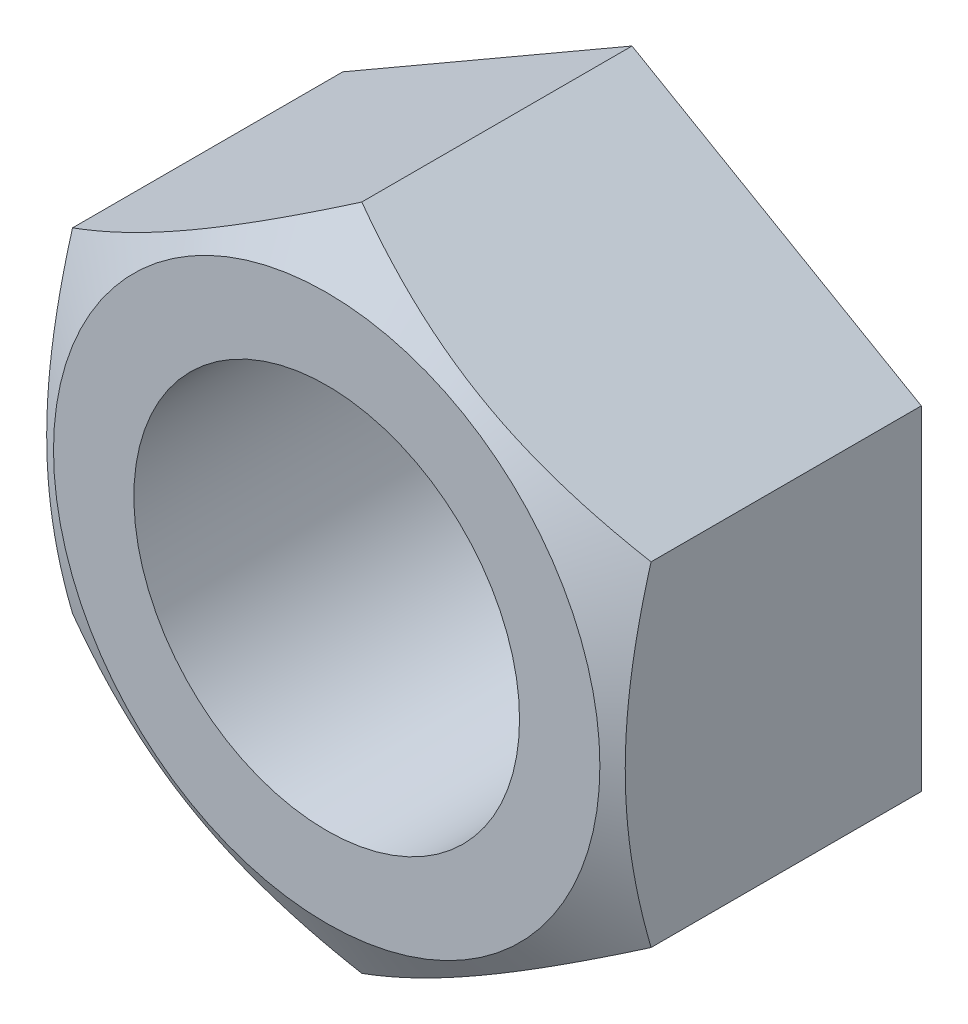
ISO-10303-21;
HEADER;
FILE_DESCRIPTION(('STEP AP214'),'2;1');
FILE_NAME('part.step','',(''),(''),'','','');
FILE_SCHEMA(('AUTOMOTIVE_DESIGN { 1 0 10303 214 1 1 1 1 }'));
ENDSEC;
DATA;
#1=APPLICATION_CONTEXT('core data for automotive mechanical design processes');
#2=APPLICATION_PROTOCOL_DEFINITION('international standard','automotive_design',2000,#1);
#3=PRODUCT_CONTEXT('',#1,'mechanical');
#4=PRODUCT('Part','Part','',(#3));
#5=PRODUCT_RELATED_PRODUCT_CATEGORY('part','',(#4));
#6=PRODUCT_DEFINITION_FORMATION('','',#4);
#7=PRODUCT_DEFINITION_CONTEXT('part definition',#1,'design');
#8=PRODUCT_DEFINITION('design','',#6,#7);
#9=PRODUCT_DEFINITION_SHAPE('','',#8);
#10=(LENGTH_UNIT() NAMED_UNIT(*) SI_UNIT(.MILLI.,.METRE.));
#11=(NAMED_UNIT(*) PLANE_ANGLE_UNIT() SI_UNIT($,.RADIAN.));
#12=(NAMED_UNIT(*) SI_UNIT($,.STERADIAN.) SOLID_ANGLE_UNIT());
#13=UNCERTAINTY_MEASURE_WITH_UNIT(LENGTH_MEASURE(1.E-05),#10,'distance_accuracy_value','');
#14=(GEOMETRIC_REPRESENTATION_CONTEXT(3) GLOBAL_UNCERTAINTY_ASSIGNED_CONTEXT((#13)) GLOBAL_UNIT_ASSIGNED_CONTEXT((#10,
#11,#12)) REPRESENTATION_CONTEXT('',''));
#15=CARTESIAN_POINT('',(0.,0.,0.));
#16=DIRECTION('',(0.,0.,1.));
#17=DIRECTION('',(1.,0.,0.));
#18=AXIS2_PLACEMENT_3D('',#15,#16,#17);
#19=CARTESIAN_POINT('',(-18.,-10.3923048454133,21.));
#20=DIRECTION('',(-1.,0.,0.));
#21=DIRECTION('',(0.,0.,1.));
#22=AXIS2_PLACEMENT_3D('',#19,#20,#21);
#23=PLANE('',#22);
#24=DIRECTION('',(0.,1.,0.));
#25=VECTOR('',#24,1.);
#26=CARTESIAN_POINT('',(-18.,-10.3923048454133,0.));
#27=LINE('',#26,#25);
#28=CARTESIAN_POINT('',(-18.,-10.3923048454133,0.));
#29=VERTEX_POINT('',#28);
#30=CARTESIAN_POINT('',(-18.,10.3923048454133,0.));
#31=VERTEX_POINT('',#30);
#32=EDGE_CURVE('E97',#29,#31,#27,.T.);
#33=ORIENTED_EDGE('',*,*,#32,.F.);
#34=DIRECTION('',(0.,0.,-1.));
#35=VECTOR('',#34,1.);
#36=CARTESIAN_POINT('',(-18.,-10.3923048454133,21.));
#37=LINE('',#36,#35);
#38=CARTESIAN_POINT('',(-18.,-10.3923048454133,16.8149545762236));
#39=VERTEX_POINT('',#38);
#40=EDGE_CURVE('E9',#39,#29,#37,.T.);
#41=ORIENTED_EDGE('',*,*,#40,.F.);
#42=CARTESIAN_POINT('',(-18.,-27.678158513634,9.75294647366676));
#43=CARTESIAN_POINT('',(-18.,-27.2860533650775,9.94272235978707));
#44=CARTESIAN_POINT('',(-18.,-26.8934816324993,10.1315337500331));
#45=CARTESIAN_POINT('',(-18.,-26.1073075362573,10.5070086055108));
#46=CARTESIAN_POINT('',(-18.,-25.7137051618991,10.693672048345));
#47=CARTESIAN_POINT('',(-18.,-24.5310977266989,11.2501628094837));
#48=CARTESIAN_POINT('',(-18.,-23.7404120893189,11.6164324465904));
#49=CARTESIAN_POINT('',(-18.,-22.1492517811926,12.3392469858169));
#50=CARTESIAN_POINT('',(-18.,-21.3487470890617,12.6957259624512));
#51=CARTESIAN_POINT('',(-18.,-19.7412878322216,13.3937806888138));
#52=CARTESIAN_POINT('',(-18.,-18.9343335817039,13.7353571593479));
#53=CARTESIAN_POINT('',(-18.,-17.2876078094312,14.4099305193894));
#54=CARTESIAN_POINT('',(-18.,-16.4475927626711,14.7423360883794));
#55=CARTESIAN_POINT('',(-18.,-14.7576419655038,15.3814120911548));
#56=CARTESIAN_POINT('',(-18.,-13.9077051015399,15.6880796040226));
#57=CARTESIAN_POINT('',(-18.,-12.1982556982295,16.2674507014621));
#58=CARTESIAN_POINT('',(-18.,-11.3387673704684,16.5402251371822));
#59=CARTESIAN_POINT('',(-18.,-9.60738310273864,17.042915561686));
#60=CARTESIAN_POINT('',(-18.,-8.73549124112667,17.2728453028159));
#61=CARTESIAN_POINT('',(-18.,-7.42060770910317,17.5765484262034));
#62=CARTESIAN_POINT('',(-18.,-6.98229810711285,17.6707239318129));
#63=CARTESIAN_POINT('',(-18.,-6.10272947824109,17.8441982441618));
#64=CARTESIAN_POINT('',(-18.,-5.66147051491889,17.9234973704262));
#65=CARTESIAN_POINT('',(-18.,-4.77633197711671,18.0658039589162));
#66=CARTESIAN_POINT('',(-18.,-4.33245247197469,18.1288118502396));
#67=CARTESIAN_POINT('',(-18.,-3.44253895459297,18.2372744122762));
#68=CARTESIAN_POINT('',(-18.,-2.99650494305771,18.2827290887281));
#69=CARTESIAN_POINT('',(-18.,-2.10864948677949,18.3546213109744));
#70=CARTESIAN_POINT('',(-18.,-1.66684728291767,18.3812950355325));
#71=CARTESIAN_POINT('',(-18.,-0.78251257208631,18.4159525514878));
#72=CARTESIAN_POINT('',(-18.,-0.339980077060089,18.4239366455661));
#73=CARTESIAN_POINT('',(-18.,0.545029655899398,18.4210256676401));
#74=CARTESIAN_POINT('',(-18.,0.987506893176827,18.4101303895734));
#75=CARTESIAN_POINT('',(-18.,1.8716145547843,18.3697222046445));
#76=CARTESIAN_POINT('',(-18.,2.31324493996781,18.3402084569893));
#77=CARTESIAN_POINT('',(-18.,3.38188442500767,18.2468825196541));
#78=CARTESIAN_POINT('',(-18.,4.0081005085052,18.1738337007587));
#79=CARTESIAN_POINT('',(-18.,5.2557313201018,17.9943375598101));
#80=CARTESIAN_POINT('',(-18.,5.87714535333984,17.8878854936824));
#81=CARTESIAN_POINT('',(-18.,7.11463218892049,17.6453701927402));
#82=CARTESIAN_POINT('',(-18.,7.73070028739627,17.509283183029));
#83=CARTESIAN_POINT('',(-18.,8.95658242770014,17.2116364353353));
#84=CARTESIAN_POINT('',(-18.,9.56639657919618,17.0500771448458));
#85=CARTESIAN_POINT('',(-18.,10.7930692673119,16.7016152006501));
#86=CARTESIAN_POINT('',(-18.,11.4097918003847,16.5142370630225));
#87=CARTESIAN_POINT('',(-18.,12.6371592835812,16.1206335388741));
#88=CARTESIAN_POINT('',(-18.,13.247804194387,15.9144080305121));
#89=CARTESIAN_POINT('',(-18.,14.4633274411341,15.4863391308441));
#90=CARTESIAN_POINT('',(-18.,15.068207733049,15.2645012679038));
#91=CARTESIAN_POINT('',(-18.,16.272990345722,14.8077670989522));
#92=CARTESIAN_POINT('',(-18.,16.8728927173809,14.5728709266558));
#93=CARTESIAN_POINT('',(-18.,18.2575646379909,14.0160878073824));
#94=CARTESIAN_POINT('',(-18.,19.0407253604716,13.6902065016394));
#95=CARTESIAN_POINT('',(-18.,20.6006658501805,13.0234723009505));
#96=CARTESIAN_POINT('',(-18.,21.3774452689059,12.6826185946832));
#97=CARTESIAN_POINT('',(-18.,22.9257732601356,11.988856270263));
#98=CARTESIAN_POINT('',(-18.,23.6973207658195,11.6359452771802));
#99=CARTESIAN_POINT('',(-18.,25.2358803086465,10.9204307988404));
#100=CARTESIAN_POINT('',(-18.,26.0028924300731,10.557827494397));
#101=CARTESIAN_POINT('',(-18.,27.5338791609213,9.82432596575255));
#102=CARTESIAN_POINT('',(-18.,28.2978499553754,9.4534197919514));
#103=CARTESIAN_POINT('',(-18.,29.8225723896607,8.70505034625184));
#104=CARTESIAN_POINT('',(-18.,30.58332401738,8.32758704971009));
#105=CARTESIAN_POINT('',(-18.,32.1020057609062,7.56724265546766));
#106=CARTESIAN_POINT('',(-18.,32.8599361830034,7.18436216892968));
#107=CARTESIAN_POINT('',(-18.,34.3734558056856,6.41400905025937));
#108=CARTESIAN_POINT('',(-18.,35.12904501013,6.02653642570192));
#109=CARTESIAN_POINT('',(-18.,37.2715446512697,4.92088640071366));
#110=CARTESIAN_POINT('',(-18.,38.6560721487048,4.1980913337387));
#111=CARTESIAN_POINT('',(-18.,41.4199837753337,2.74265154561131));
#112=CARTESIAN_POINT('',(-18.,42.7993677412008,2.01000651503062));
#113=CARTESIAN_POINT('',(-18.,45.5509144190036,0.538834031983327));
#114=CARTESIAN_POINT('',(-18.,46.9230864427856,-0.199676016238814));
#115=CARTESIAN_POINT('',(-18.,48.9789029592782,-1.31186595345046));
#116=CARTESIAN_POINT('',(-18.,49.6637511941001,-1.68332410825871));
#117=CARTESIAN_POINT('',(-18.,51.0327239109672,-2.42756928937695));
#118=CARTESIAN_POINT('',(-18.,51.7168483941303,-2.80035631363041));
#119=CARTESIAN_POINT('',(-18.,52.4006513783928,-3.17373230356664));
#120=B_SPLINE_CURVE_WITH_KNOTS('',3,(#42,#43,#44,#45,#46,#47,#48,#49,#50,#51,#52,#53,#54,#55,
#56,#57,#58,#59,#60,#61,#62,#63,#64,#65,#66,#67,#68,#69,#70,#71,#72,#73,#74,#75,#76,#77,#78,#79,
#80,#81,#82,#83,#84,#85,#86,#87,#88,#89,#90,#91,#92,#93,#94,#95,#96,#97,#98,#99,#100,#101,#102,
#103,#104,#105,#106,#107,#108,#109,#110,#111,#112,#113,#114,#115,#116,#117,#118,#119),
.UNSPECIFIED.,.F.,.F.,(4,2,2,2,2,2,2,2,2,2,2,2,2,2,2,2,2,2,2,2,2,2,2,2,2,2,2,2,2,2,2,2,2,2,2,2,
2,2,4),(0.,1.30684567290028,2.61370496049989,5.22782279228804,7.85657604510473,10.4852020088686,
13.1950587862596,15.9052226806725,18.6096222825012,21.3131523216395,22.657878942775,
24.0025766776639,25.347238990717,26.69190086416,28.0193354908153,29.3467486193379,
30.6741762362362,32.0016638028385,33.8919994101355,35.7826036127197,37.6747301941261,
39.5668235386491,41.5001415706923,43.4334721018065,45.3661214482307,47.2987510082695,
49.8433127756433,52.3880125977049,54.933216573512,57.4783731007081,60.0260805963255,
62.5737976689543,65.1212295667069,67.6686572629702,72.3541222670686,77.0397348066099,
81.7145709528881,84.0518726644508,86.3891707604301),.UNSPECIFIED.);
#121=CARTESIAN_POINT('',(-18.,10.3923048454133,16.8149545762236));
#122=VERTEX_POINT('',#121);
#123=EDGE_CURVE('E36',#39,#122,#120,.T.);
#124=ORIENTED_EDGE('',*,*,#123,.T.);
#125=DIRECTION('',(0.,0.,-1.));
#126=VECTOR('',#125,1.);
#127=CARTESIAN_POINT('',(-18.,10.3923048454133,21.));
#128=LINE('',#127,#126);
#129=EDGE_CURVE('E177',#122,#31,#128,.T.);
#130=ORIENTED_EDGE('',*,*,#129,.T.);
#131=EDGE_LOOP('',(#33,#41,#124,#130));
#132=FACE_BOUND('',#131,.T.);
#133=ADVANCED_FACE('F14',(#132),#23,.T.);
#134=CARTESIAN_POINT('',(-18.,-10.3923048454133,21.));
#135=DIRECTION('',(0.5,0.86602540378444,0.));
#136=DIRECTION('',(-0.86602540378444,0.5,0.));
#137=AXIS2_PLACEMENT_3D('',#134,#135,#136);
#138=PLANE('',#137);
#139=DIRECTION('',(-0.866025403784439,0.5,0.));
#140=VECTOR('',#139,1.);
#141=CARTESIAN_POINT('',(0.,-20.7846096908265,0.));
#142=LINE('',#141,#140);
#143=CARTESIAN_POINT('',(0.,-20.7846096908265,0.));
#144=VERTEX_POINT('',#143);
#145=EDGE_CURVE('E94',#144,#29,#142,.T.);
#146=ORIENTED_EDGE('',*,*,#145,.F.);
#147=DIRECTION('',(0.,0.,-1.));
#148=VECTOR('',#147,1.);
#149=CARTESIAN_POINT('',(0.,-20.7846096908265,21.));
#150=LINE('',#149,#148);
#151=CARTESIAN_POINT('',(0.,-20.7846096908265,16.8149545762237));
#152=VERTEX_POINT('',#151);
#153=EDGE_CURVE('E23',#152,#144,#150,.T.);
#154=ORIENTED_EDGE('',*,*,#153,.F.);
#155=CARTESIAN_POINT('',(-18.0002,-10.3921893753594,16.8148879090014));
#156=CARTESIAN_POINT('',(-17.6045674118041,-10.6206079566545,16.9467563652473));
#157=CARTESIAN_POINT('',(-17.2073916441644,-10.8499174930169,17.0726408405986));
#158=CARTESIAN_POINT('',(-16.4098552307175,-11.310375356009,17.3107784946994));
#159=CARTESIAN_POINT('',(-16.0094935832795,-11.5415242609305,17.423027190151));
#160=CARTESIAN_POINT('',(-15.2048116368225,-12.0061075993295,17.6323844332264));
#161=CARTESIAN_POINT('',(-14.8004842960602,-12.2395460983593,17.7294571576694));
#162=CARTESIAN_POINT('',(-13.9890201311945,-12.7080451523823,17.9063779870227));
#163=CARTESIAN_POINT('',(-13.5818834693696,-12.9431056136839,17.9862270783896));
#164=CARTESIAN_POINT('',(-12.7752328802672,-13.4088255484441,18.1253044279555));
#165=CARTESIAN_POINT('',(-12.3757788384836,-13.6394504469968,18.1849930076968));
#166=CARTESIAN_POINT('',(-11.5750403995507,-14.1017570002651,18.2850773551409));
#167=CARTESIAN_POINT('',(-11.1737559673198,-14.3334386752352,18.3254727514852));
#168=CARTESIAN_POINT('',(-10.370513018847,-14.7971912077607,18.3859507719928));
#169=CARTESIAN_POINT('',(-9.96855587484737,-15.0292612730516,18.4060575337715));
#170=CARTESIAN_POINT('',(-9.16427056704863,-15.4936156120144,18.425525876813));
#171=CARTESIAN_POINT('',(-8.76194241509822,-15.7258998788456,18.4248880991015));
#172=CARTESIAN_POINT('',(-8.0097806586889,-16.1601606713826,18.404316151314));
#173=CARTESIAN_POINT('',(-7.65989346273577,-16.3621681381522,18.3868905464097));
#174=CARTESIAN_POINT('',(-6.96095368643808,-16.765701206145,18.3366806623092));
#175=CARTESIAN_POINT('',(-6.61190109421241,-16.9672268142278,18.3038966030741));
#176=CARTESIAN_POINT('',(-5.91476277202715,-17.3697198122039,18.2235386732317));
#177=CARTESIAN_POINT('',(-5.56667820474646,-17.5706865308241,18.1759514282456));
#178=CARTESIAN_POINT('',(-4.87216610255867,-17.9716632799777,18.0668268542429));
#179=CARTESIAN_POINT('',(-4.5257385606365,-18.1716733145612,18.0052895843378));
#180=CARTESIAN_POINT('',(-3.47411308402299,-18.7788295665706,17.7981876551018));
#181=CARTESIAN_POINT('',(-2.77196054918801,-19.1842175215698,17.6319722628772));
#182=CARTESIAN_POINT('',(-1.37812528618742,-19.9889486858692,17.2547315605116));
#183=CARTESIAN_POINT('',(-0.686424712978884,-20.3883021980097,17.0437948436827));
#184=CARTESIAN_POINT('',(0.00019999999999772,-20.7847251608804,16.8148879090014));
#185=B_SPLINE_CURVE_WITH_KNOTS('',3,(#155,#156,#157,#158,#159,#160,#161,#162,#163,#164,#165,
#166,#167,#168,#169,#170,#171,#172,#173,#174,#175,#176,#177,#178,#179,#180,#181,#182,#183,#184),
.UNSPECIFIED.,.F.,.F.,(4,2,2,2,2,2,2,2,2,2,2,2,2,2,4),(0.,1.42650335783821,2.85347447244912,
4.28376471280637,5.71397301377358,7.10888071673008,8.5038152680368,9.8970882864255,
11.2903182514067,12.5031974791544,13.7160593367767,14.9300201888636,16.1439758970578,
18.6253607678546,21.1018751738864),.UNSPECIFIED.);
#186=EDGE_CURVE('E146',#39,#152,#185,.T.);
#187=ORIENTED_EDGE('',*,*,#186,.F.);
#188=ORIENTED_EDGE('',*,*,#40,.T.);
#189=EDGE_LOOP('',(#146,#154,#187,#188));
#190=FACE_BOUND('',#189,.T.);
#191=ADVANCED_FACE('F16',(#190),#138,.F.);
#192=CARTESIAN_POINT('',(18.,-10.3923048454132,21.));
#193=DIRECTION('',(0.5,-0.866025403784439,0.));
#194=DIRECTION('',(0.86602540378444,0.5,0.));
#195=AXIS2_PLACEMENT_3D('',#192,#193,#194);
#196=PLANE('',#195);
#197=DIRECTION('',(-0.866025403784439,-0.5,0.));
#198=VECTOR('',#197,1.);
#199=CARTESIAN_POINT('',(18.,-10.3923048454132,0.));
#200=LINE('',#199,#198);
#201=CARTESIAN_POINT('',(18.,-10.3923048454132,0.));
#202=VERTEX_POINT('',#201);
#203=EDGE_CURVE('E85',#202,#144,#200,.T.);
#204=ORIENTED_EDGE('',*,*,#203,.F.);
#205=DIRECTION('',(0.,0.,-1.));
#206=VECTOR('',#205,1.);
#207=CARTESIAN_POINT('',(18.,-10.3923048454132,21.));
#208=LINE('',#207,#206);
#209=CARTESIAN_POINT('',(18.,-10.3923048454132,16.8149545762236));
#210=VERTEX_POINT('',#209);
#211=EDGE_CURVE('E75',#210,#202,#208,.T.);
#212=ORIENTED_EDGE('',*,*,#211,.F.);
#213=CARTESIAN_POINT('',(18.0002,-10.3921893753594,16.8148879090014));
#214=CARTESIAN_POINT('',(17.6045674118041,-10.6206079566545,16.9467563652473));
#215=CARTESIAN_POINT('',(17.2073916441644,-10.8499174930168,17.0726408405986));
#216=CARTESIAN_POINT('',(16.4098552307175,-11.3103753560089,17.3107784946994));
#217=CARTESIAN_POINT('',(16.0094935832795,-11.5415242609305,17.4230271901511));
#218=CARTESIAN_POINT('',(15.2048116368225,-12.0061075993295,17.6323844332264));
#219=CARTESIAN_POINT('',(14.8004842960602,-12.2395460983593,17.7294571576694));
#220=CARTESIAN_POINT('',(13.9890201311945,-12.7080451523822,17.9063779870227));
#221=CARTESIAN_POINT('',(13.5818834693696,-12.9431056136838,17.9862270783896));
#222=CARTESIAN_POINT('',(12.7752328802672,-13.4088255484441,18.1253044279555));
#223=CARTESIAN_POINT('',(12.3757788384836,-13.6394504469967,18.1849930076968));
#224=CARTESIAN_POINT('',(11.5750403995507,-14.1017570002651,18.2850773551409));
#225=CARTESIAN_POINT('',(11.1737559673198,-14.3334386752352,18.3254727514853));
#226=CARTESIAN_POINT('',(10.3705130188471,-14.7971912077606,18.3859507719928));
#227=CARTESIAN_POINT('',(9.96855587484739,-15.0292612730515,18.4060575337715));
#228=CARTESIAN_POINT('',(9.16427056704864,-15.4936156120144,18.425525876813));
#229=CARTESIAN_POINT('',(8.76194241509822,-15.7258998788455,18.4248880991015));
#230=CARTESIAN_POINT('',(8.0097806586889,-16.1601606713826,18.404316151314));
#231=CARTESIAN_POINT('',(7.65989346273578,-16.3621681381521,18.3868905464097));
#232=CARTESIAN_POINT('',(6.96095368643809,-16.765701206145,18.3366806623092));
#233=CARTESIAN_POINT('',(6.61190109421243,-16.9672268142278,18.3038966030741));
#234=CARTESIAN_POINT('',(5.91476277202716,-17.3697198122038,18.2235386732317));
#235=CARTESIAN_POINT('',(5.56667820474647,-17.5706865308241,18.1759514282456));
#236=CARTESIAN_POINT('',(4.87216610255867,-17.9716632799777,18.066826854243));
#237=CARTESIAN_POINT('',(4.52573856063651,-18.1716733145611,18.0052895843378));
#238=CARTESIAN_POINT('',(3.47411308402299,-18.7788295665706,17.7981876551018));
#239=CARTESIAN_POINT('',(2.77196054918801,-19.1842175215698,17.6319722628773));
#240=CARTESIAN_POINT('',(1.37812528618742,-19.9889486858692,17.2547315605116));
#241=CARTESIAN_POINT('',(0.686424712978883,-20.3883021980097,17.0437948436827));
#242=CARTESIAN_POINT('',(-0.000199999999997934,-20.7847251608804,16.8148879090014));
#243=B_SPLINE_CURVE_WITH_KNOTS('',3,(#213,#214,#215,#216,#217,#218,#219,#220,#221,#222,#223,
#224,#225,#226,#227,#228,#229,#230,#231,#232,#233,#234,#235,#236,#237,#238,#239,#240,#241,#242),
.UNSPECIFIED.,.F.,.F.,(4,2,2,2,2,2,2,2,2,2,2,2,2,2,4),(0.,1.42650335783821,2.85347447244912,
4.28376471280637,5.71397301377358,7.10888071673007,8.5038152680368,9.89708828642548,
11.2903182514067,12.5031974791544,13.7160593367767,14.9300201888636,16.1439758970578,
18.6253607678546,21.1018751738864),.UNSPECIFIED.);
#244=EDGE_CURVE('E140',#210,#152,#243,.T.);
#245=ORIENTED_EDGE('',*,*,#244,.T.);
#246=ORIENTED_EDGE('',*,*,#153,.T.);
#247=EDGE_LOOP('',(#204,#212,#245,#246));
#248=FACE_BOUND('',#247,.T.);
#249=ADVANCED_FACE('F185',(#248),#196,.T.);
#250=CARTESIAN_POINT('',(18.,-10.3923048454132,21.));
#251=DIRECTION('',(-1.,0.,0.));
#252=DIRECTION('',(0.,0.,1.));
#253=AXIS2_PLACEMENT_3D('',#250,#251,#252);
#254=PLANE('',#253);
#255=DIRECTION('',(0.,-1.,0.));
#256=VECTOR('',#255,1.);
#257=CARTESIAN_POINT('',(18.,10.3923048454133,0.));
#258=LINE('',#257,#256);
#259=CARTESIAN_POINT('',(18.,10.3923048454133,0.));
#260=VERTEX_POINT('',#259);
#261=EDGE_CURVE('E79',#260,#202,#258,.T.);
#262=ORIENTED_EDGE('',*,*,#261,.F.);
#263=DIRECTION('',(0.,0.,-1.));
#264=VECTOR('',#263,1.);
#265=CARTESIAN_POINT('',(18.,10.3923048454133,21.));
#266=LINE('',#265,#264);
#267=CARTESIAN_POINT('',(18.,10.3923048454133,16.8149545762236));
#268=VERTEX_POINT('',#267);
#269=EDGE_CURVE('E66',#268,#260,#266,.T.);
#270=ORIENTED_EDGE('',*,*,#269,.F.);
#271=CARTESIAN_POINT('',(18.,-27.6781585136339,9.75294647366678));
#272=CARTESIAN_POINT('',(18.,-27.2860533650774,9.94272235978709));
#273=CARTESIAN_POINT('',(18.,-26.8934816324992,10.1315337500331));
#274=CARTESIAN_POINT('',(18.,-26.1073075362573,10.5070086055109));
#275=CARTESIAN_POINT('',(18.,-25.7137051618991,10.6936720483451));
#276=CARTESIAN_POINT('',(18.,-24.5310977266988,11.2501628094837));
#277=CARTESIAN_POINT('',(18.,-23.7404120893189,11.6164324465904));
#278=CARTESIAN_POINT('',(18.,-22.1492517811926,12.3392469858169));
#279=CARTESIAN_POINT('',(18.,-21.3487470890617,12.6957259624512));
#280=CARTESIAN_POINT('',(18.,-19.7412878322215,13.3937806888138));
#281=CARTESIAN_POINT('',(18.,-18.9343335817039,13.735357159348));
#282=CARTESIAN_POINT('',(18.,-17.2876078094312,14.4099305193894));
#283=CARTESIAN_POINT('',(18.,-16.4475927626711,14.7423360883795));
#284=CARTESIAN_POINT('',(18.,-14.7576419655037,15.3814120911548));
#285=CARTESIAN_POINT('',(18.,-13.9077051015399,15.6880796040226));
#286=CARTESIAN_POINT('',(18.,-12.1982556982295,16.2674507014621));
#287=CARTESIAN_POINT('',(18.,-11.3387673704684,16.5402251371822));
#288=CARTESIAN_POINT('',(18.,-9.60738310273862,17.042915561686));
#289=CARTESIAN_POINT('',(18.,-8.73549124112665,17.2728453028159));
#290=CARTESIAN_POINT('',(18.,-7.42060770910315,17.5765484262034));
#291=CARTESIAN_POINT('',(18.,-6.98229810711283,17.6707239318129));
#292=CARTESIAN_POINT('',(18.,-6.10272947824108,17.8441982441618));
#293=CARTESIAN_POINT('',(18.,-5.66147051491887,17.9234973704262));
#294=CARTESIAN_POINT('',(18.,-4.7763319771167,18.0658039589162));
#295=CARTESIAN_POINT('',(18.,-4.33245247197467,18.1288118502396));
#296=CARTESIAN_POINT('',(18.,-3.44253895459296,18.2372744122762));
#297=CARTESIAN_POINT('',(18.,-2.99650494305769,18.2827290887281));
#298=CARTESIAN_POINT('',(18.,-2.10864948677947,18.3546213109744));
#299=CARTESIAN_POINT('',(18.,-1.66684728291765,18.3812950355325));
#300=CARTESIAN_POINT('',(18.,-0.782512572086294,18.4159525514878));
#301=CARTESIAN_POINT('',(18.,-0.339980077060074,18.4239366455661));
#302=CARTESIAN_POINT('',(18.,0.545029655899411,18.4210256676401));
#303=CARTESIAN_POINT('',(18.,0.987506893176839,18.4101303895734));
#304=CARTESIAN_POINT('',(18.,1.87161455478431,18.3697222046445));
#305=CARTESIAN_POINT('',(18.,2.31324493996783,18.3402084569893));
#306=CARTESIAN_POINT('',(18.,3.38188442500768,18.2468825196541));
#307=CARTESIAN_POINT('',(18.,4.0081005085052,18.1738337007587));
#308=CARTESIAN_POINT('',(18.,5.25573132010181,17.99433755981));
#309=CARTESIAN_POINT('',(18.,5.87714535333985,17.8878854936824));
#310=CARTESIAN_POINT('',(18.,7.1146321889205,17.6453701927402));
#311=CARTESIAN_POINT('',(18.,7.73070028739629,17.509283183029));
#312=CARTESIAN_POINT('',(18.,8.95658242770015,17.2116364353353));
#313=CARTESIAN_POINT('',(18.,9.56639657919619,17.0500771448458));
#314=CARTESIAN_POINT('',(18.,10.7930692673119,16.7016152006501));
#315=CARTESIAN_POINT('',(18.,11.4097918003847,16.5142370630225));
#316=CARTESIAN_POINT('',(18.,12.6371592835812,16.1206335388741));
#317=CARTESIAN_POINT('',(18.,13.247804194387,15.9144080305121));
#318=CARTESIAN_POINT('',(18.,14.4633274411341,15.4863391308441));
#319=CARTESIAN_POINT('',(18.,15.068207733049,15.2645012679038));
#320=CARTESIAN_POINT('',(18.,16.272990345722,14.8077670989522));
#321=CARTESIAN_POINT('',(18.,16.8728927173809,14.5728709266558));
#322=CARTESIAN_POINT('',(18.,18.2575646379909,14.0160878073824));
#323=CARTESIAN_POINT('',(18.,19.0407253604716,13.6902065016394));
#324=CARTESIAN_POINT('',(18.,20.6006658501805,13.0234723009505));
#325=CARTESIAN_POINT('',(18.,21.3774452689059,12.6826185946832));
#326=CARTESIAN_POINT('',(18.,22.9257732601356,11.988856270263));
#327=CARTESIAN_POINT('',(18.,23.6973207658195,11.6359452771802));
#328=CARTESIAN_POINT('',(18.,25.2358803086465,10.9204307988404));
#329=CARTESIAN_POINT('',(18.,26.0028924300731,10.557827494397));
#330=CARTESIAN_POINT('',(18.,27.5338791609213,9.82432596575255));
#331=CARTESIAN_POINT('',(18.,28.2978499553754,9.45341979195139));
#332=CARTESIAN_POINT('',(18.,29.8225723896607,8.70505034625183));
#333=CARTESIAN_POINT('',(18.,30.58332401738,8.32758704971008));
#334=CARTESIAN_POINT('',(18.,32.1020057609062,7.56724265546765));
#335=CARTESIAN_POINT('',(18.,32.8599361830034,7.18436216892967));
#336=CARTESIAN_POINT('',(18.,34.3734558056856,6.41400905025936));
#337=CARTESIAN_POINT('',(18.,35.12904501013,6.02653642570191));
#338=CARTESIAN_POINT('',(18.,37.2715446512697,4.92088640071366));
#339=CARTESIAN_POINT('',(18.,38.6560721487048,4.1980913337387));
#340=CARTESIAN_POINT('',(18.,41.4199837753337,2.74265154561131));
#341=CARTESIAN_POINT('',(18.,42.7993677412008,2.01000651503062));
#342=CARTESIAN_POINT('',(18.,45.5509144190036,0.538834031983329));
#343=CARTESIAN_POINT('',(18.,46.9230864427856,-0.199676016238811));
#344=CARTESIAN_POINT('',(18.,48.9789029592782,-1.31186595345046));
#345=CARTESIAN_POINT('',(18.,49.6637511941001,-1.68332410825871));
#346=CARTESIAN_POINT('',(18.,51.0327239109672,-2.42756928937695));
#347=CARTESIAN_POINT('',(18.,51.7168483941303,-2.80035631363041));
#348=CARTESIAN_POINT('',(18.,52.4006513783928,-3.17373230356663));
#349=B_SPLINE_CURVE_WITH_KNOTS('',3,(#271,#272,#273,#274,#275,#276,#277,#278,#279,#280,#281,
#282,#283,#284,#285,#286,#287,#288,#289,#290,#291,#292,#293,#294,#295,#296,#297,#298,#299,#300,
#301,#302,#303,#304,#305,#306,#307,#308,#309,#310,#311,#312,#313,#314,#315,#316,#317,#318,#319,
#320,#321,#322,#323,#324,#325,#326,#327,#328,#329,#330,#331,#332,#333,#334,#335,#336,#337,#338,
#339,#340,#341,#342,#343,#344,#345,#346,#347,#348),.UNSPECIFIED.,.F.,.F.,(4,2,2,2,2,2,2,2,2,2,2,
2,2,2,2,2,2,2,2,2,2,2,2,2,2,2,2,2,2,2,2,2,2,2,2,2,2,2,4),(0.,1.30684567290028,2.61370496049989,
5.22782279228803,7.85657604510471,10.4852020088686,13.1950587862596,15.9052226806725,
18.6096222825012,21.3131523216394,22.657878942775,24.0025766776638,25.3472389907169,
26.6919008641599,28.0193354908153,29.3467486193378,30.6741762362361,32.0016638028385,
33.8919994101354,35.7826036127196,37.674730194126,39.566823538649,41.5001415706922,
43.4334721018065,45.3661214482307,47.2987510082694,49.8433127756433,52.3880125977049,
54.933216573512,57.4783731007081,60.0260805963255,62.5737976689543,65.1212295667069,
67.6686572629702,72.3541222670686,77.0397348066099,81.7145709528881,84.0518726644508,
86.38917076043),.UNSPECIFIED.);
#350=EDGE_CURVE('E133',#210,#268,#349,.T.);
#351=ORIENTED_EDGE('',*,*,#350,.F.);
#352=ORIENTED_EDGE('',*,*,#211,.T.);
#353=EDGE_LOOP('',(#262,#270,#351,#352));
#354=FACE_BOUND('',#353,.T.);
#355=ADVANCED_FACE('F80',(#354),#254,.F.);
#356=CARTESIAN_POINT('',(18.,10.3923048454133,21.));
#357=DIRECTION('',(-0.5,-0.86602540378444,0.));
#358=DIRECTION('',(0.86602540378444,-0.5,0.));
#359=AXIS2_PLACEMENT_3D('',#356,#357,#358);
#360=PLANE('',#359);
#361=DIRECTION('',(0.866025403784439,-0.5,0.));
#362=VECTOR('',#361,1.);
#363=CARTESIAN_POINT('',(0.,20.7846096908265,0.));
#364=LINE('',#363,#362);
#365=CARTESIAN_POINT('',(0.,20.7846096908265,0.));
#366=VERTEX_POINT('',#365);
#367=EDGE_CURVE('E71',#366,#260,#364,.T.);
#368=ORIENTED_EDGE('',*,*,#367,.F.);
#369=DIRECTION('',(0.,0.,-1.));
#370=VECTOR('',#369,1.);
#371=CARTESIAN_POINT('',(0.,20.7846096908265,21.));
#372=LINE('',#371,#370);
#373=CARTESIAN_POINT('',(0.,20.7846096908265,16.8149545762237));
#374=VERTEX_POINT('',#373);
#375=EDGE_CURVE('E76',#374,#366,#372,.T.);
#376=ORIENTED_EDGE('',*,*,#375,.F.);
#377=CARTESIAN_POINT('',(18.0002,10.3921893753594,16.8148879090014));
#378=CARTESIAN_POINT('',(17.6045674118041,10.6206079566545,16.9467563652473));
#379=CARTESIAN_POINT('',(17.2073916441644,10.8499174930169,17.0726408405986));
#380=CARTESIAN_POINT('',(16.4098552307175,11.310375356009,17.3107784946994));
#381=CARTESIAN_POINT('',(16.0094935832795,11.5415242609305,17.423027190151));
#382=CARTESIAN_POINT('',(15.2048116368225,12.0061075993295,17.6323844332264));
#383=CARTESIAN_POINT('',(14.8004842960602,12.2395460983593,17.7294571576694));
#384=CARTESIAN_POINT('',(13.9890201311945,12.7080451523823,17.9063779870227));
#385=CARTESIAN_POINT('',(13.5818834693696,12.9431056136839,17.9862270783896));
#386=CARTESIAN_POINT('',(12.7752328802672,13.4088255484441,18.1253044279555));
#387=CARTESIAN_POINT('',(12.3757788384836,13.6394504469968,18.1849930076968));
#388=CARTESIAN_POINT('',(11.5750403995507,14.1017570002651,18.2850773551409));
#389=CARTESIAN_POINT('',(11.1737559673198,14.3334386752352,18.3254727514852));
#390=CARTESIAN_POINT('',(10.370513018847,14.7971912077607,18.3859507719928));
#391=CARTESIAN_POINT('',(9.96855587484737,15.0292612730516,18.4060575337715));
#392=CARTESIAN_POINT('',(9.16427056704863,15.4936156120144,18.425525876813));
#393=CARTESIAN_POINT('',(8.76194241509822,15.7258998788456,18.4248880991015));
#394=CARTESIAN_POINT('',(8.0097806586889,16.1601606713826,18.404316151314));
#395=CARTESIAN_POINT('',(7.65989346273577,16.3621681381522,18.3868905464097));
#396=CARTESIAN_POINT('',(6.96095368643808,16.765701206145,18.3366806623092));
#397=CARTESIAN_POINT('',(6.61190109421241,16.9672268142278,18.3038966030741));
#398=CARTESIAN_POINT('',(5.91476277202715,17.3697198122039,18.2235386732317));
#399=CARTESIAN_POINT('',(5.56667820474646,17.5706865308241,18.1759514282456));
#400=CARTESIAN_POINT('',(4.87216610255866,17.9716632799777,18.0668268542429));
#401=CARTESIAN_POINT('',(4.5257385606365,18.1716733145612,18.0052895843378));
#402=CARTESIAN_POINT('',(3.47411308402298,18.7788295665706,17.7981876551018));
#403=CARTESIAN_POINT('',(2.77196054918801,19.1842175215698,17.6319722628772));
#404=CARTESIAN_POINT('',(1.37812528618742,19.9889486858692,17.2547315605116));
#405=CARTESIAN_POINT('',(0.68642471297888,20.3883021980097,17.0437948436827));
#406=CARTESIAN_POINT('',(-0.000200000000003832,20.7847251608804,16.8148879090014));
#407=B_SPLINE_CURVE_WITH_KNOTS('',3,(#377,#378,#379,#380,#381,#382,#383,#384,#385,#386,#387,
#388,#389,#390,#391,#392,#393,#394,#395,#396,#397,#398,#399,#400,#401,#402,#403,#404,#405,#406),
.UNSPECIFIED.,.F.,.F.,(4,2,2,2,2,2,2,2,2,2,2,2,2,2,4),(0.,1.42650335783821,2.85347447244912,
4.28376471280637,5.71397301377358,7.10888071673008,8.5038152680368,9.8970882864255,
11.2903182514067,12.5031974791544,13.7160593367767,14.9300201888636,16.1439758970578,
18.6253607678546,21.1018751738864),.UNSPECIFIED.);
#408=EDGE_CURVE('E30',#268,#374,#407,.T.);
#409=ORIENTED_EDGE('',*,*,#408,.F.);
#410=ORIENTED_EDGE('',*,*,#269,.T.);
#411=EDGE_LOOP('',(#368,#376,#409,#410));
#412=FACE_BOUND('',#411,.T.);
#413=ADVANCED_FACE('F68',(#412),#360,.F.);
#414=CARTESIAN_POINT('',(-18.,10.3923048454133,21.));
#415=DIRECTION('',(-0.5,0.86602540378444,0.));
#416=DIRECTION('',(-0.86602540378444,-0.5,0.));
#417=AXIS2_PLACEMENT_3D('',#414,#415,#416);
#418=PLANE('',#417);
#419=DIRECTION('',(0.866025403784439,0.5,0.));
#420=VECTOR('',#419,1.);
#421=CARTESIAN_POINT('',(-18.,10.3923048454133,0.));
#422=LINE('',#421,#420);
#423=EDGE_CURVE('E90',#31,#366,#422,.T.);
#424=ORIENTED_EDGE('',*,*,#423,.F.);
#425=ORIENTED_EDGE('',*,*,#129,.F.);
#426=CARTESIAN_POINT('',(-18.0002,10.3921893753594,16.8148879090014));
#427=CARTESIAN_POINT('',(-17.6045674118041,10.6206079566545,16.9467563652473));
#428=CARTESIAN_POINT('',(-17.2073916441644,10.8499174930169,17.0726408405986));
#429=CARTESIAN_POINT('',(-16.4098552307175,11.310375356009,17.3107784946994));
#430=CARTESIAN_POINT('',(-16.0094935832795,11.5415242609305,17.423027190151));
#431=CARTESIAN_POINT('',(-15.2048116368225,12.0061075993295,17.6323844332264));
#432=CARTESIAN_POINT('',(-14.8004842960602,12.2395460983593,17.7294571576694));
#433=CARTESIAN_POINT('',(-13.9890201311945,12.7080451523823,17.9063779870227));
#434=CARTESIAN_POINT('',(-13.5818834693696,12.9431056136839,17.9862270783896));
#435=CARTESIAN_POINT('',(-12.7752328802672,13.4088255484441,18.1253044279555));
#436=CARTESIAN_POINT('',(-12.3757788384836,13.6394504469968,18.1849930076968));
#437=CARTESIAN_POINT('',(-11.5750403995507,14.1017570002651,18.2850773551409));
#438=CARTESIAN_POINT('',(-11.1737559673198,14.3334386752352,18.3254727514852));
#439=CARTESIAN_POINT('',(-10.370513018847,14.7971912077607,18.3859507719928));
#440=CARTESIAN_POINT('',(-9.96855587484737,15.0292612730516,18.4060575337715));
#441=CARTESIAN_POINT('',(-9.16427056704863,15.4936156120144,18.425525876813));
#442=CARTESIAN_POINT('',(-8.76194241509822,15.7258998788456,18.4248880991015));
#443=CARTESIAN_POINT('',(-8.0097806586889,16.1601606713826,18.404316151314));
#444=CARTESIAN_POINT('',(-7.65989346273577,16.3621681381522,18.3868905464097));
#445=CARTESIAN_POINT('',(-6.96095368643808,16.765701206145,18.3366806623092));
#446=CARTESIAN_POINT('',(-6.61190109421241,16.9672268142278,18.3038966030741));
#447=CARTESIAN_POINT('',(-5.91476277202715,17.3697198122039,18.2235386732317));
#448=CARTESIAN_POINT('',(-5.56667820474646,17.5706865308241,18.1759514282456));
#449=CARTESIAN_POINT('',(-4.87216610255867,17.9716632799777,18.0668268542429));
#450=CARTESIAN_POINT('',(-4.5257385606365,18.1716733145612,18.0052895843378));
#451=CARTESIAN_POINT('',(-3.47411308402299,18.7788295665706,17.7981876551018));
#452=CARTESIAN_POINT('',(-2.77196054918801,19.1842175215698,17.6319722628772));
#453=CARTESIAN_POINT('',(-1.37812528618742,19.9889486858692,17.2547315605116));
#454=CARTESIAN_POINT('',(-0.686424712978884,20.3883021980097,17.0437948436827));
#455=CARTESIAN_POINT('',(0.00019999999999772,20.7847251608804,16.8148879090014));
#456=B_SPLINE_CURVE_WITH_KNOTS('',3,(#426,#427,#428,#429,#430,#431,#432,#433,#434,#435,#436,
#437,#438,#439,#440,#441,#442,#443,#444,#445,#446,#447,#448,#449,#450,#451,#452,#453,#454,#455),
.UNSPECIFIED.,.F.,.F.,(4,2,2,2,2,2,2,2,2,2,2,2,2,2,4),(0.,1.42650335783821,2.85347447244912,
4.28376471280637,5.71397301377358,7.10888071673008,8.5038152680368,9.8970882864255,
11.2903182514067,12.5031974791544,13.7160593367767,14.9300201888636,16.1439758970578,
18.6253607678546,21.1018751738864),.UNSPECIFIED.);
#457=EDGE_CURVE('E103',#122,#374,#456,.T.);
#458=ORIENTED_EDGE('',*,*,#457,.T.);
#459=ORIENTED_EDGE('',*,*,#375,.T.);
#460=EDGE_LOOP('',(#424,#425,#458,#459));
#461=FACE_BOUND('',#460,.T.);
#462=ADVANCED_FACE('F117',(#461),#418,.T.);
#463=CARTESIAN_POINT('',(-18.,10.3923048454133,19.));
#464=DIRECTION('',(0.,0.,1.));
#465=DIRECTION('',(1.,0.,0.));
#466=AXIS2_PLACEMENT_3D('',#463,#464,#465);
#467=PLANE('',#466);
#468=CARTESIAN_POINT('',(0.,0.,19.));
#469=DIRECTION('',(0.,0.,1.));
#470=DIRECTION('',(1.,0.,0.));
#471=AXIS2_PLACEMENT_3D('',#468,#469,#470);
#472=CIRCLE('',#471,12.);
#473=CARTESIAN_POINT('',(12.,0.,19.));
#474=VERTEX_POINT('',#473);
#475=EDGE_CURVE('E156',#474,#474,#472,.T.);
#476=ORIENTED_EDGE('',*,*,#475,.F.);
#477=EDGE_LOOP('',(#476));
#478=FACE_BOUND('',#477,.T.);
#479=CARTESIAN_POINT('',(0.,0.,19.));
#480=DIRECTION('',(0.,0.,1.));
#481=DIRECTION('',(1.,0.,0.));
#482=AXIS2_PLACEMENT_3D('',#479,#480,#481);
#483=CIRCLE('',#482,17.);
#484=CARTESIAN_POINT('',(17.,0.,19.));
#485=VERTEX_POINT('',#484);
#486=EDGE_CURVE('E100',#485,#485,#483,.T.);
#487=ORIENTED_EDGE('',*,*,#486,.T.);
#488=EDGE_LOOP('',(#487));
#489=FACE_BOUND('',#488,.T.);
#490=ADVANCED_FACE('F125',(#478,#489),#467,.T.);
#491=CARTESIAN_POINT('',(-18.,10.3923048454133,0.));
#492=DIRECTION('',(0.,0.,-1.));
#493=DIRECTION('',(0.,-1.,0.));
#494=AXIS2_PLACEMENT_3D('',#491,#492,#493);
#495=PLANE('',#494);
#496=CARTESIAN_POINT('',(0.,0.,0.));
#497=DIRECTION('',(0.,0.,-1.));
#498=DIRECTION('',(0.,-1.,0.));
#499=AXIS2_PLACEMENT_3D('',#496,#497,#498);
#500=CIRCLE('',#499,12.);
#501=CARTESIAN_POINT('',(0.,-12.,0.));
#502=VERTEX_POINT('',#501);
#503=EDGE_CURVE('E173',#502,#502,#500,.T.);
#504=ORIENTED_EDGE('',*,*,#503,.F.);
#505=EDGE_LOOP('',(#504));
#506=FACE_BOUND('',#505,.T.);
#507=ORIENTED_EDGE('',*,*,#367,.T.);
#508=ORIENTED_EDGE('',*,*,#261,.T.);
#509=ORIENTED_EDGE('',*,*,#203,.T.);
#510=ORIENTED_EDGE('',*,*,#145,.T.);
#511=ORIENTED_EDGE('',*,*,#32,.T.);
#512=ORIENTED_EDGE('',*,*,#423,.T.);
#513=EDGE_LOOP('',(#507,#508,#509,#510,#511,#512));
#514=FACE_BOUND('',#513,.T.);
#515=ADVANCED_FACE('F87',(#506,#514),#495,.T.);
#516=CARTESIAN_POINT('',(0.,0.,21.));
#517=DIRECTION('',(0.,0.,-1.));
#518=DIRECTION('',(0.,-1.,0.));
#519=AXIS2_PLACEMENT_3D('',#516,#517,#518);
#520=CYLINDRICAL_SURFACE('',#519,12.);
#521=ORIENTED_EDGE('',*,*,#503,.T.);
#522=EDGE_LOOP('',(#521));
#523=FACE_BOUND('',#522,.T.);
#524=ORIENTED_EDGE('',*,*,#475,.T.);
#525=EDGE_LOOP('',(#524));
#526=FACE_BOUND('',#525,.T.);
#527=ADVANCED_FACE('F124',(#523,#526),#520,.F.);
#528=CARTESIAN_POINT('',(0.,0.,19.));
#529=DIRECTION('',(0.,0.,-1.));
#530=DIRECTION('',(-1.,0.,0.));
#531=AXIS2_PLACEMENT_3D('',#528,#529,#530);
#532=CONICAL_SURFACE('',#531,17.,1.0471975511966);
#533=ORIENTED_EDGE('',*,*,#186,.T.);
#534=ORIENTED_EDGE('',*,*,#244,.F.);
#535=ORIENTED_EDGE('',*,*,#350,.T.);
#536=ORIENTED_EDGE('',*,*,#408,.T.);
#537=ORIENTED_EDGE('',*,*,#457,.F.);
#538=ORIENTED_EDGE('',*,*,#123,.F.);
#539=EDGE_LOOP('',(#533,#534,#535,#536,#537,#538));
#540=FACE_BOUND('',#539,.T.);
#541=ORIENTED_EDGE('',*,*,#486,.F.);
#542=EDGE_LOOP('',(#541));
#543=FACE_BOUND('',#542,.T.);
#544=ADVANCED_FACE('F120',(#540,#543),#532,.T.);
#545=CLOSED_SHELL('',(#133,#191,#249,#355,#413,#462,#490,#515,#527,#544));
#546=MANIFOLD_SOLID_BREP('B1',#545);
#547=ADVANCED_BREP_SHAPE_REPRESENTATION('',(#18,#546),#14);
#548=SHAPE_DEFINITION_REPRESENTATION(#9,#547);
ENDSEC;
END-ISO-10303-21;
